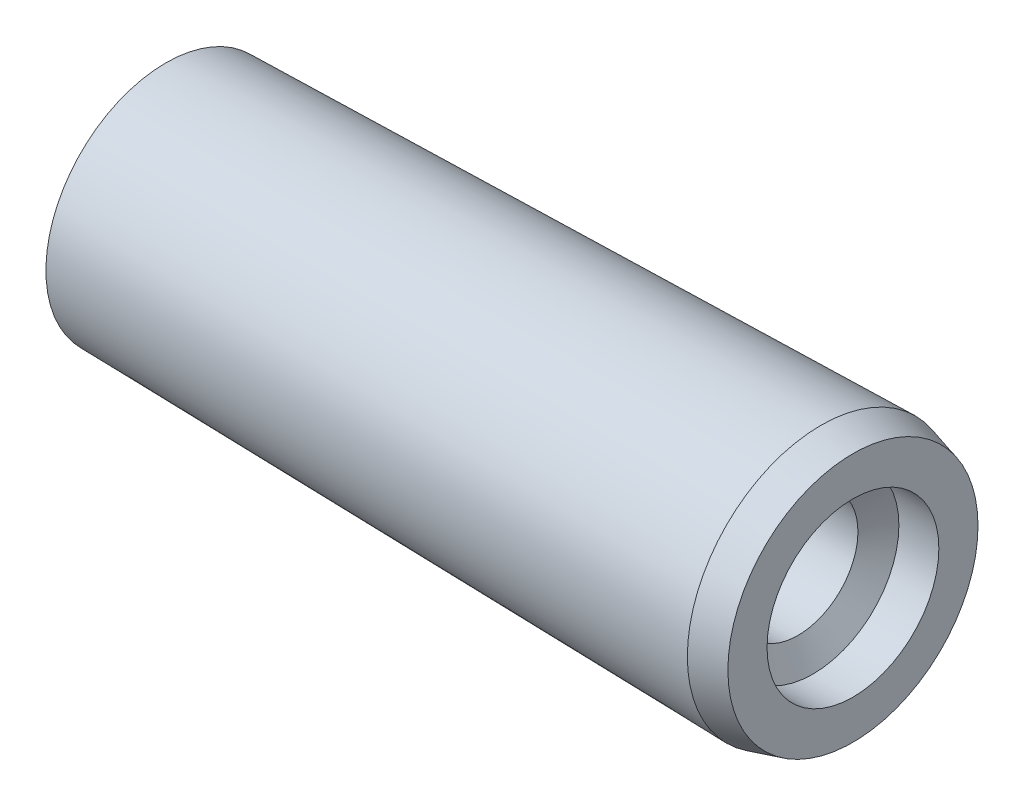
ISO-10303-21;
HEADER;
FILE_DESCRIPTION(('STEP AP214'),'2;1');
FILE_NAME('part.step','',(''),(''),'','','');
FILE_SCHEMA(('AUTOMOTIVE_DESIGN { 1 0 10303 214 1 1 1 1 }'));
ENDSEC;
DATA;
#1=APPLICATION_CONTEXT('core data for automotive mechanical design processes');
#2=APPLICATION_PROTOCOL_DEFINITION('international standard','automotive_design',2000,#1);
#3=PRODUCT_CONTEXT('',#1,'mechanical');
#4=PRODUCT('Part','Part','',(#3));
#5=PRODUCT_RELATED_PRODUCT_CATEGORY('part','',(#4));
#6=PRODUCT_DEFINITION_FORMATION('','',#4);
#7=PRODUCT_DEFINITION_CONTEXT('part definition',#1,'design');
#8=PRODUCT_DEFINITION('design','',#6,#7);
#9=PRODUCT_DEFINITION_SHAPE('','',#8);
#10=(LENGTH_UNIT() NAMED_UNIT(*) SI_UNIT(.MILLI.,.METRE.));
#11=(NAMED_UNIT(*) PLANE_ANGLE_UNIT() SI_UNIT($,.RADIAN.));
#12=(NAMED_UNIT(*) SI_UNIT($,.STERADIAN.) SOLID_ANGLE_UNIT());
#13=UNCERTAINTY_MEASURE_WITH_UNIT(LENGTH_MEASURE(1.E-05),#10,'distance_accuracy_value','');
#14=(GEOMETRIC_REPRESENTATION_CONTEXT(3) GLOBAL_UNCERTAINTY_ASSIGNED_CONTEXT((#13)) GLOBAL_UNIT_ASSIGNED_CONTEXT((#10,
#11,#12)) REPRESENTATION_CONTEXT('',''));
#15=CARTESIAN_POINT('',(0.,0.,0.));
#16=DIRECTION('',(0.,0.,1.));
#17=DIRECTION('',(1.,0.,0.));
#18=AXIS2_PLACEMENT_3D('',#15,#16,#17);
#19=CARTESIAN_POINT('',(6.,0.,0.));
#20=DIRECTION('',(1.,0.,0.));
#21=DIRECTION('',(0.,1.,0.));
#22=AXIS2_PLACEMENT_3D('',#19,#20,#21);
#23=SPHERICAL_SURFACE('',#22,6.);
#24=CARTESIAN_POINT('',(0.803847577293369,0.,0.));
#25=DIRECTION('',(1.,0.,0.));
#26=DIRECTION('',(0.,0.,-1.));
#27=AXIS2_PLACEMENT_3D('',#24,#25,#26);
#28=CIRCLE('',#27,3.);
#29=CARTESIAN_POINT('',(0.803847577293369,0.,-3.));
#30=VERTEX_POINT('',#29);
#31=EDGE_CURVE('E64',#30,#30,#28,.T.);
#32=ORIENTED_EDGE('',*,*,#31,.F.);
#33=EDGE_LOOP('',(#32));
#34=FACE_BOUND('',#33,.T.);
#35=ADVANCED_FACE('F35',(#34),#23,.T.);
#36=CARTESIAN_POINT('',(18.,0.,0.));
#37=DIRECTION('',(1.,0.,0.));
#38=DIRECTION('',(0.,0.,-1.));
#39=AXIS2_PLACEMENT_3D('',#36,#37,#38);
#40=PLANE('',#39);
#41=CARTESIAN_POINT('',(18.,0.,0.));
#42=DIRECTION('',(1.,0.,0.));
#43=DIRECTION('',(0.,1.,0.));
#44=AXIS2_PLACEMENT_3D('',#41,#42,#43);
#45=CIRCLE('',#44,2.15);
#46=CARTESIAN_POINT('',(18.,2.15,0.));
#47=VERTEX_POINT('',#46);
#48=EDGE_CURVE('E61',#47,#47,#45,.T.);
#49=ORIENTED_EDGE('',*,*,#48,.F.);
#50=EDGE_LOOP('',(#49));
#51=FACE_BOUND('',#50,.T.);
#52=CARTESIAN_POINT('',(18.,0.,0.));
#53=DIRECTION('',(1.,0.,0.));
#54=DIRECTION('',(0.,0.,-1.));
#55=AXIS2_PLACEMENT_3D('',#52,#53,#54);
#56=CIRCLE('',#55,3.1296406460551);
#57=CARTESIAN_POINT('',(18.,0.,-3.1296406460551));
#58=VERTEX_POINT('',#57);
#59=EDGE_CURVE('E11',#58,#58,#56,.T.);
#60=ORIENTED_EDGE('',*,*,#59,.T.);
#61=EDGE_LOOP('',(#60));
#62=FACE_BOUND('',#61,.T.);
#63=ADVANCED_FACE('F84',(#51,#62),#40,.T.);
#64=CARTESIAN_POINT('',(18.,0.,0.));
#65=DIRECTION('',(-1.,0.,0.));
#66=DIRECTION('',(0.,0.,1.));
#67=AXIS2_PLACEMENT_3D('',#64,#65,#66);
#68=CONICAL_SURFACE('',#67,3.1296406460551,0.261799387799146);
#69=CARTESIAN_POINT('',(17.2,0.,0.));
#70=DIRECTION('',(1.,0.,0.));
#71=DIRECTION('',(0.,0.,-1.));
#72=AXIS2_PLACEMENT_3D('',#69,#70,#71);
#73=CIRCLE('',#72,3.344);
#74=CARTESIAN_POINT('',(17.2,0.,-3.344));
#75=VERTEX_POINT('',#74);
#76=EDGE_CURVE('E41',#75,#75,#73,.T.);
#77=ORIENTED_EDGE('',*,*,#76,.T.);
#78=EDGE_LOOP('',(#77));
#79=FACE_BOUND('',#78,.T.);
#80=ORIENTED_EDGE('',*,*,#59,.F.);
#81=EDGE_LOOP('',(#80));
#82=FACE_BOUND('',#81,.T.);
#83=ADVANCED_FACE('F69',(#79,#82),#68,.T.);
#84=CARTESIAN_POINT('',(17.2,0.,0.));
#85=DIRECTION('',(1.,0.,0.));
#86=DIRECTION('',(0.,0.,-1.));
#87=AXIS2_PLACEMENT_3D('',#84,#85,#86);
#88=CONICAL_SURFACE('',#87,3.344,0.0209774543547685);
#89=ORIENTED_EDGE('',*,*,#31,.T.);
#90=EDGE_LOOP('',(#89));
#91=FACE_BOUND('',#90,.T.);
#92=ORIENTED_EDGE('',*,*,#76,.F.);
#93=EDGE_LOOP('',(#92));
#94=FACE_BOUND('',#93,.T.);
#95=ADVANCED_FACE('F72',(#91,#94),#88,.T.);
#96=CARTESIAN_POINT('',(18.,0.,0.));
#97=DIRECTION('',(1.,0.,0.));
#98=DIRECTION('',(0.,1.,0.));
#99=AXIS2_PLACEMENT_3D('',#96,#97,#98);
#100=CYLINDRICAL_SURFACE('',#99,2.15);
#101=CARTESIAN_POINT('',(17.,0.,0.));
#102=DIRECTION('',(1.,0.,0.));
#103=DIRECTION('',(0.,1.,0.));
#104=AXIS2_PLACEMENT_3D('',#101,#102,#103);
#105=CIRCLE('',#104,2.15);
#106=CARTESIAN_POINT('',(17.,2.15,0.));
#107=VERTEX_POINT('',#106);
#108=EDGE_CURVE('E56',#107,#107,#105,.T.);
#109=ORIENTED_EDGE('',*,*,#108,.F.);
#110=EDGE_LOOP('',(#109));
#111=FACE_BOUND('',#110,.T.);
#112=ORIENTED_EDGE('',*,*,#48,.T.);
#113=EDGE_LOOP('',(#112));
#114=FACE_BOUND('',#113,.T.);
#115=ADVANCED_FACE('F74',(#111,#114),#100,.F.);
#116=CARTESIAN_POINT('',(17.,0.,0.));
#117=DIRECTION('',(1.,0.,0.));
#118=DIRECTION('',(0.,1.,0.));
#119=AXIS2_PLACEMENT_3D('',#116,#117,#118);
#120=CONICAL_SURFACE('',#119,2.15,1.04719755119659);
#121=CARTESIAN_POINT('',(16.6247223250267,0.,0.));
#122=DIRECTION('',(1.,0.,0.));
#123=DIRECTION('',(0.,1.,0.));
#124=AXIS2_PLACEMENT_3D('',#121,#122,#123);
#125=CIRCLE('',#124,1.5);
#126=CARTESIAN_POINT('',(16.6247223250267,1.5,0.));
#127=VERTEX_POINT('',#126);
#128=EDGE_CURVE('E53',#127,#127,#125,.T.);
#129=ORIENTED_EDGE('',*,*,#128,.F.);
#130=EDGE_LOOP('',(#129));
#131=FACE_BOUND('',#130,.T.);
#132=ORIENTED_EDGE('',*,*,#108,.T.);
#133=EDGE_LOOP('',(#132));
#134=FACE_BOUND('',#133,.T.);
#135=ADVANCED_FACE('F81',(#131,#134),#120,.F.);
#136=CARTESIAN_POINT('',(18.,0.,0.));
#137=DIRECTION('',(1.,0.,0.));
#138=DIRECTION('',(0.,1.,0.));
#139=AXIS2_PLACEMENT_3D('',#136,#137,#138);
#140=CYLINDRICAL_SURFACE('',#139,1.5);
#141=CARTESIAN_POINT('',(8.,0.,0.));
#142=DIRECTION('',(1.,0.,0.));
#143=DIRECTION('',(0.,1.,0.));
#144=AXIS2_PLACEMENT_3D('',#141,#142,#143);
#145=CIRCLE('',#144,1.5);
#146=CARTESIAN_POINT('',(8.,1.5,0.));
#147=VERTEX_POINT('',#146);
#148=EDGE_CURVE('E51',#147,#147,#145,.T.);
#149=ORIENTED_EDGE('',*,*,#148,.F.);
#150=EDGE_LOOP('',(#149));
#151=FACE_BOUND('',#150,.T.);
#152=ORIENTED_EDGE('',*,*,#128,.T.);
#153=EDGE_LOOP('',(#152));
#154=FACE_BOUND('',#153,.T.);
#155=ADVANCED_FACE('F47',(#151,#154),#140,.F.);
#156=CARTESIAN_POINT('',(8.,0.,0.));
#157=DIRECTION('',(1.,0.,0.));
#158=DIRECTION('',(0.,1.,0.));
#159=AXIS2_PLACEMENT_3D('',#156,#157,#158);
#160=CONICAL_SURFACE('',#159,1.5,1.04719755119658);
#161=CARTESIAN_POINT('',(7.13397459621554,0.,0.));
#162=VERTEX_POINT('',#161);
#163=VERTEX_LOOP('',#162);
#164=FACE_BOUND('',#163,.T.);
#165=ORIENTED_EDGE('',*,*,#148,.T.);
#166=EDGE_LOOP('',(#165));
#167=FACE_BOUND('',#166,.T.);
#168=ADVANCED_FACE('F44',(#164,#167),#160,.F.);
#169=CLOSED_SHELL('',(#35,#63,#83,#95,#115,#135,#155,#168));
#170=MANIFOLD_SOLID_BREP('B2',#169);
#171=ADVANCED_BREP_SHAPE_REPRESENTATION('',(#18,#170),#14);
#172=SHAPE_DEFINITION_REPRESENTATION(#9,#171);
ENDSEC;
END-ISO-10303-21;
